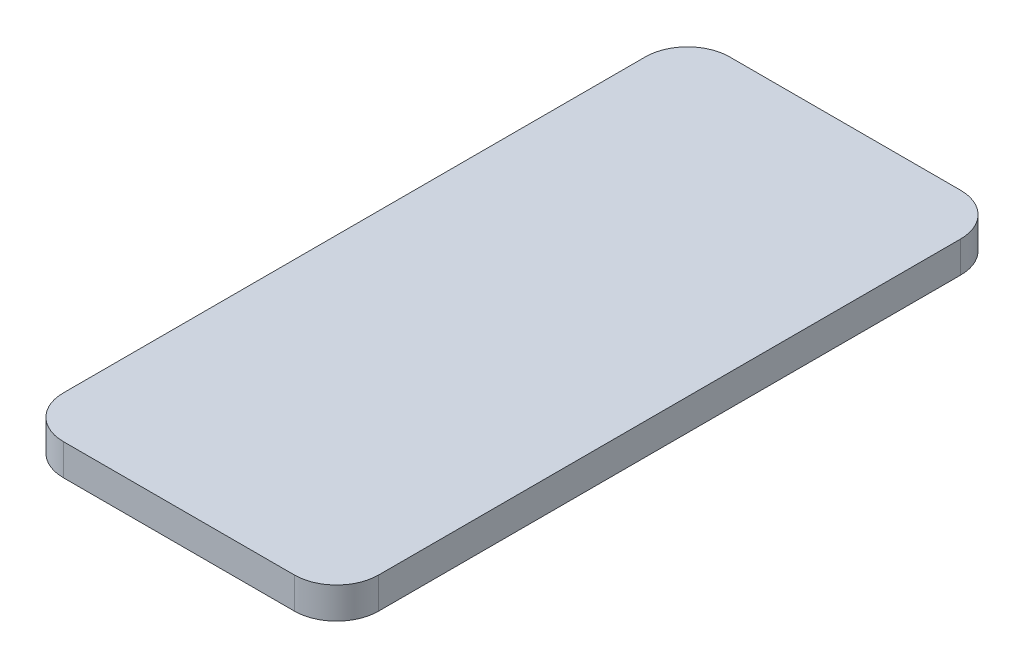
ISO-10303-21;
HEADER;
FILE_DESCRIPTION(('STEP AP214'),'2;1');
FILE_NAME('part.step','',(''),(''),'','','');
FILE_SCHEMA(('AUTOMOTIVE_DESIGN { 1 0 10303 214 1 1 1 1 }'));
ENDSEC;
DATA;
#1=APPLICATION_CONTEXT('core data for automotive mechanical design processes');
#2=APPLICATION_PROTOCOL_DEFINITION('international standard','automotive_design',2000,#1);
#3=PRODUCT_CONTEXT('',#1,'mechanical');
#4=PRODUCT('Part','Part','',(#3));
#5=PRODUCT_RELATED_PRODUCT_CATEGORY('part','',(#4));
#6=PRODUCT_DEFINITION_FORMATION('','',#4);
#7=PRODUCT_DEFINITION_CONTEXT('part definition',#1,'design');
#8=PRODUCT_DEFINITION('design','',#6,#7);
#9=PRODUCT_DEFINITION_SHAPE('','',#8);
#10=(LENGTH_UNIT() NAMED_UNIT(*) SI_UNIT(.MILLI.,.METRE.));
#11=(NAMED_UNIT(*) PLANE_ANGLE_UNIT() SI_UNIT($,.RADIAN.));
#12=(NAMED_UNIT(*) SI_UNIT($,.STERADIAN.) SOLID_ANGLE_UNIT());
#13=UNCERTAINTY_MEASURE_WITH_UNIT(LENGTH_MEASURE(1.E-05),#10,'distance_accuracy_value','');
#14=(GEOMETRIC_REPRESENTATION_CONTEXT(3) GLOBAL_UNCERTAINTY_ASSIGNED_CONTEXT((#13)) GLOBAL_UNIT_ASSIGNED_CONTEXT((#10,
#11,#12)) REPRESENTATION_CONTEXT('',''));
#15=CARTESIAN_POINT('',(0.,0.,0.));
#16=DIRECTION('',(0.,0.,1.));
#17=DIRECTION('',(1.,0.,0.));
#18=AXIS2_PLACEMENT_3D('',#15,#16,#17);
#19=CARTESIAN_POINT('',(-27.365,-7.42,10.));
#20=DIRECTION('',(0.,1.,0.));
#21=DIRECTION('',(0.,0.,1.));
#22=AXIS2_PLACEMENT_3D('',#19,#20,#21);
#23=CYLINDRICAL_SURFACE('',#22,10.);
#24=CARTESIAN_POINT('',(-27.365,0.,10.));
#25=DIRECTION('',(0.,1.,0.));
#26=DIRECTION('',(0.,0.,-1.));
#27=AXIS2_PLACEMENT_3D('',#24,#25,#26);
#28=CIRCLE('',#27,10.);
#29=CARTESIAN_POINT('',(-27.365,0.,0.));
#30=VERTEX_POINT('',#29);
#31=CARTESIAN_POINT('',(-37.365,0.,10.));
#32=VERTEX_POINT('',#31);
#33=EDGE_CURVE('E136',#30,#32,#28,.T.);
#34=ORIENTED_EDGE('',*,*,#33,.F.);
#35=DIRECTION('',(0.,1.,0.));
#36=VECTOR('',#35,1.);
#37=CARTESIAN_POINT('',(-27.365,-7.42,0.));
#38=LINE('',#37,#36);
#39=CARTESIAN_POINT('',(-27.365,-7.42,0.));
#40=VERTEX_POINT('',#39);
#41=EDGE_CURVE('E11',#40,#30,#38,.T.);
#42=ORIENTED_EDGE('',*,*,#41,.F.);
#43=CARTESIAN_POINT('',(-27.365,-7.42,10.));
#44=DIRECTION('',(0.,1.,0.));
#45=DIRECTION('',(0.,0.,-1.));
#46=AXIS2_PLACEMENT_3D('',#43,#44,#45);
#47=CIRCLE('',#46,10.);
#48=CARTESIAN_POINT('',(-37.365,-7.42,10.));
#49=VERTEX_POINT('',#48);
#50=EDGE_CURVE('E156',#40,#49,#47,.T.);
#51=ORIENTED_EDGE('',*,*,#50,.T.);
#52=DIRECTION('',(0.,1.,0.));
#53=VECTOR('',#52,1.);
#54=CARTESIAN_POINT('',(-37.365,-7.42,10.));
#55=LINE('',#54,#53);
#56=EDGE_CURVE('E42',#49,#32,#55,.T.);
#57=ORIENTED_EDGE('',*,*,#56,.T.);
#58=EDGE_LOOP('',(#34,#42,#51,#57));
#59=FACE_BOUND('',#58,.T.);
#60=ADVANCED_FACE('F39',(#59),#23,.T.);
#61=CARTESIAN_POINT('',(-27.365,-7.42,0.));
#62=DIRECTION('',(0.,0.,-1.));
#63=DIRECTION('',(-1.,0.,0.));
#64=AXIS2_PLACEMENT_3D('',#61,#62,#63);
#65=PLANE('',#64);
#66=DIRECTION('',(-1.,0.,0.));
#67=VECTOR('',#66,1.);
#68=CARTESIAN_POINT('',(-27.365,0.,0.));
#69=LINE('',#68,#67);
#70=CARTESIAN_POINT('',(27.365,0.,0.));
#71=VERTEX_POINT('',#70);
#72=EDGE_CURVE('E154',#71,#30,#69,.T.);
#73=ORIENTED_EDGE('',*,*,#72,.F.);
#74=DIRECTION('',(0.,1.,0.));
#75=VECTOR('',#74,1.);
#76=CARTESIAN_POINT('',(27.365,-7.42,0.));
#77=LINE('',#76,#75);
#78=CARTESIAN_POINT('',(27.365,-7.42,0.));
#79=VERTEX_POINT('',#78);
#80=EDGE_CURVE('E48',#79,#71,#77,.T.);
#81=ORIENTED_EDGE('',*,*,#80,.F.);
#82=DIRECTION('',(-1.,0.,0.));
#83=VECTOR('',#82,1.);
#84=CARTESIAN_POINT('',(-27.365,-7.42,0.));
#85=LINE('',#84,#83);
#86=EDGE_CURVE('E126',#79,#40,#85,.T.);
#87=ORIENTED_EDGE('',*,*,#86,.T.);
#88=ORIENTED_EDGE('',*,*,#41,.T.);
#89=EDGE_LOOP('',(#73,#81,#87,#88));
#90=FACE_BOUND('',#89,.T.);
#91=ADVANCED_FACE('F168',(#90),#65,.T.);
#92=CARTESIAN_POINT('',(27.365,-7.42,10.));
#93=DIRECTION('',(0.,1.,0.));
#94=DIRECTION('',(0.,0.,1.));
#95=AXIS2_PLACEMENT_3D('',#92,#93,#94);
#96=CYLINDRICAL_SURFACE('',#95,10.);
#97=CARTESIAN_POINT('',(27.365,0.,10.));
#98=DIRECTION('',(0.,1.,0.));
#99=DIRECTION('',(0.,0.,-1.));
#100=AXIS2_PLACEMENT_3D('',#97,#98,#99);
#101=CIRCLE('',#100,10.);
#102=CARTESIAN_POINT('',(37.365,0.,10.));
#103=VERTEX_POINT('',#102);
#104=EDGE_CURVE('E113',#103,#71,#101,.T.);
#105=ORIENTED_EDGE('',*,*,#104,.F.);
#106=DIRECTION('',(0.,1.,0.));
#107=VECTOR('',#106,1.);
#108=CARTESIAN_POINT('',(37.365,-7.42,10.));
#109=LINE('',#108,#107);
#110=CARTESIAN_POINT('',(37.365,-7.42,10.));
#111=VERTEX_POINT('',#110);
#112=EDGE_CURVE('E108',#111,#103,#109,.T.);
#113=ORIENTED_EDGE('',*,*,#112,.F.);
#114=CARTESIAN_POINT('',(27.365,-7.42,10.));
#115=DIRECTION('',(0.,1.,0.));
#116=DIRECTION('',(0.,0.,-1.));
#117=AXIS2_PLACEMENT_3D('',#114,#115,#116);
#118=CIRCLE('',#117,10.);
#119=EDGE_CURVE('E111',#111,#79,#118,.T.);
#120=ORIENTED_EDGE('',*,*,#119,.T.);
#121=ORIENTED_EDGE('',*,*,#80,.T.);
#122=EDGE_LOOP('',(#105,#113,#120,#121));
#123=FACE_BOUND('',#122,.T.);
#124=ADVANCED_FACE('F110',(#123),#96,.T.);
#125=CARTESIAN_POINT('',(37.365,-7.42,10.));
#126=DIRECTION('',(1.,0.,0.));
#127=DIRECTION('',(0.,0.,-1.));
#128=AXIS2_PLACEMENT_3D('',#125,#126,#127);
#129=PLANE('',#128);
#130=DIRECTION('',(0.,0.,-1.));
#131=VECTOR('',#130,1.);
#132=CARTESIAN_POINT('',(37.365,0.,10.));
#133=LINE('',#132,#131);
#134=CARTESIAN_POINT('',(37.365,0.,147.9));
#135=VERTEX_POINT('',#134);
#136=EDGE_CURVE('E151',#135,#103,#133,.T.);
#137=ORIENTED_EDGE('',*,*,#136,.F.);
#138=DIRECTION('',(0.,1.,0.));
#139=VECTOR('',#138,1.);
#140=CARTESIAN_POINT('',(37.365,-7.42,147.9));
#141=LINE('',#140,#139);
#142=CARTESIAN_POINT('',(37.365,-7.42,147.9));
#143=VERTEX_POINT('',#142);
#144=EDGE_CURVE('E118',#143,#135,#141,.T.);
#145=ORIENTED_EDGE('',*,*,#144,.F.);
#146=DIRECTION('',(0.,0.,-1.));
#147=VECTOR('',#146,1.);
#148=CARTESIAN_POINT('',(37.365,-7.42,10.));
#149=LINE('',#148,#147);
#150=EDGE_CURVE('E124',#143,#111,#149,.T.);
#151=ORIENTED_EDGE('',*,*,#150,.T.);
#152=ORIENTED_EDGE('',*,*,#112,.T.);
#153=EDGE_LOOP('',(#137,#145,#151,#152));
#154=FACE_BOUND('',#153,.T.);
#155=ADVANCED_FACE('F128',(#154),#129,.T.);
#156=CARTESIAN_POINT('',(27.365,-7.42,147.9));
#157=DIRECTION('',(0.,1.,0.));
#158=DIRECTION('',(0.,0.,1.));
#159=AXIS2_PLACEMENT_3D('',#156,#157,#158);
#160=CYLINDRICAL_SURFACE('',#159,10.);
#161=CARTESIAN_POINT('',(27.365,0.,147.9));
#162=DIRECTION('',(0.,1.,0.));
#163=DIRECTION('',(0.,0.,-1.));
#164=AXIS2_PLACEMENT_3D('',#161,#162,#163);
#165=CIRCLE('',#164,10.);
#166=CARTESIAN_POINT('',(27.365,0.,157.9));
#167=VERTEX_POINT('',#166);
#168=EDGE_CURVE('E148',#167,#135,#165,.T.);
#169=ORIENTED_EDGE('',*,*,#168,.F.);
#170=DIRECTION('',(0.,1.,0.));
#171=VECTOR('',#170,1.);
#172=CARTESIAN_POINT('',(27.365,-7.42,157.9));
#173=LINE('',#172,#171);
#174=CARTESIAN_POINT('',(27.365,-7.42,157.9));
#175=VERTEX_POINT('',#174);
#176=EDGE_CURVE('E160',#175,#167,#173,.T.);
#177=ORIENTED_EDGE('',*,*,#176,.F.);
#178=CARTESIAN_POINT('',(27.365,-7.42,147.9));
#179=DIRECTION('',(0.,1.,0.));
#180=DIRECTION('',(0.,0.,-1.));
#181=AXIS2_PLACEMENT_3D('',#178,#179,#180);
#182=CIRCLE('',#181,10.);
#183=EDGE_CURVE('E129',#175,#143,#182,.T.);
#184=ORIENTED_EDGE('',*,*,#183,.T.);
#185=ORIENTED_EDGE('',*,*,#144,.T.);
#186=EDGE_LOOP('',(#169,#177,#184,#185));
#187=FACE_BOUND('',#186,.T.);
#188=ADVANCED_FACE('F181',(#187),#160,.T.);
#189=CARTESIAN_POINT('',(27.365,-7.42,157.9));
#190=DIRECTION('',(0.,0.,1.));
#191=DIRECTION('',(1.,0.,0.));
#192=AXIS2_PLACEMENT_3D('',#189,#190,#191);
#193=PLANE('',#192);
#194=DIRECTION('',(1.,0.,0.));
#195=VECTOR('',#194,1.);
#196=CARTESIAN_POINT('',(27.365,0.,157.9));
#197=LINE('',#196,#195);
#198=CARTESIAN_POINT('',(-27.365,0.,157.9));
#199=VERTEX_POINT('',#198);
#200=EDGE_CURVE('E145',#199,#167,#197,.T.);
#201=ORIENTED_EDGE('',*,*,#200,.F.);
#202=DIRECTION('',(0.,1.,0.));
#203=VECTOR('',#202,1.);
#204=CARTESIAN_POINT('',(-27.365,-7.42,157.9));
#205=LINE('',#204,#203);
#206=CARTESIAN_POINT('',(-27.365,-7.42,157.9));
#207=VERTEX_POINT('',#206);
#208=EDGE_CURVE('E162',#207,#199,#205,.T.);
#209=ORIENTED_EDGE('',*,*,#208,.F.);
#210=DIRECTION('',(1.,0.,0.));
#211=VECTOR('',#210,1.);
#212=CARTESIAN_POINT('',(27.365,-7.42,157.9));
#213=LINE('',#212,#211);
#214=EDGE_CURVE('E131',#207,#175,#213,.T.);
#215=ORIENTED_EDGE('',*,*,#214,.T.);
#216=ORIENTED_EDGE('',*,*,#176,.T.);
#217=EDGE_LOOP('',(#201,#209,#215,#216));
#218=FACE_BOUND('',#217,.T.);
#219=ADVANCED_FACE('F184',(#218),#193,.T.);
#220=CARTESIAN_POINT('',(-27.365,-7.42,147.9));
#221=DIRECTION('',(0.,1.,0.));
#222=DIRECTION('',(0.,0.,1.));
#223=AXIS2_PLACEMENT_3D('',#220,#221,#222);
#224=CYLINDRICAL_SURFACE('',#223,10.);
#225=CARTESIAN_POINT('',(-27.365,0.,147.9));
#226=DIRECTION('',(0.,1.,0.));
#227=DIRECTION('',(0.,0.,-1.));
#228=AXIS2_PLACEMENT_3D('',#225,#226,#227);
#229=CIRCLE('',#228,10.);
#230=CARTESIAN_POINT('',(-37.365,0.,147.9));
#231=VERTEX_POINT('',#230);
#232=EDGE_CURVE('E142',#231,#199,#229,.T.);
#233=ORIENTED_EDGE('',*,*,#232,.F.);
#234=DIRECTION('',(0.,1.,0.));
#235=VECTOR('',#234,1.);
#236=CARTESIAN_POINT('',(-37.365,-7.42,147.9));
#237=LINE('',#236,#235);
#238=CARTESIAN_POINT('',(-37.365,-7.42,147.9));
#239=VERTEX_POINT('',#238);
#240=EDGE_CURVE('E163',#239,#231,#237,.T.);
#241=ORIENTED_EDGE('',*,*,#240,.F.);
#242=CARTESIAN_POINT('',(-27.365,-7.42,147.9));
#243=DIRECTION('',(0.,1.,0.));
#244=DIRECTION('',(0.,0.,-1.));
#245=AXIS2_PLACEMENT_3D('',#242,#243,#244);
#246=CIRCLE('',#245,10.);
#247=EDGE_CURVE('E279',#239,#207,#246,.T.);
#248=ORIENTED_EDGE('',*,*,#247,.T.);
#249=ORIENTED_EDGE('',*,*,#208,.T.);
#250=EDGE_LOOP('',(#233,#241,#248,#249));
#251=FACE_BOUND('',#250,.T.);
#252=ADVANCED_FACE('F188',(#251),#224,.T.);
#253=CARTESIAN_POINT('',(-37.365,-7.42,147.9));
#254=DIRECTION('',(-1.,0.,0.));
#255=DIRECTION('',(0.,0.,1.));
#256=AXIS2_PLACEMENT_3D('',#253,#254,#255);
#257=PLANE('',#256);
#258=DIRECTION('',(0.,0.,1.));
#259=VECTOR('',#258,1.);
#260=CARTESIAN_POINT('',(-37.365,0.,147.9));
#261=LINE('',#260,#259);
#262=EDGE_CURVE('E139',#32,#231,#261,.T.);
#263=ORIENTED_EDGE('',*,*,#262,.F.);
#264=ORIENTED_EDGE('',*,*,#56,.F.);
#265=DIRECTION('',(0.,0.,1.));
#266=VECTOR('',#265,1.);
#267=CARTESIAN_POINT('',(-37.365,-7.42,147.9));
#268=LINE('',#267,#266);
#269=EDGE_CURVE('E280',#49,#239,#268,.T.);
#270=ORIENTED_EDGE('',*,*,#269,.T.);
#271=ORIENTED_EDGE('',*,*,#240,.T.);
#272=EDGE_LOOP('',(#263,#264,#270,#271));
#273=FACE_BOUND('',#272,.T.);
#274=ADVANCED_FACE('F165',(#273),#257,.T.);
#275=CARTESIAN_POINT('',(-27.365,-7.42,10.));
#276=DIRECTION('',(0.,-1.,0.));
#277=DIRECTION('',(0.,0.,-1.));
#278=AXIS2_PLACEMENT_3D('',#275,#276,#277);
#279=PLANE('',#278);
#280=ORIENTED_EDGE('',*,*,#50,.F.);
#281=ORIENTED_EDGE('',*,*,#86,.F.);
#282=ORIENTED_EDGE('',*,*,#119,.F.);
#283=ORIENTED_EDGE('',*,*,#150,.F.);
#284=ORIENTED_EDGE('',*,*,#183,.F.);
#285=ORIENTED_EDGE('',*,*,#214,.F.);
#286=ORIENTED_EDGE('',*,*,#247,.F.);
#287=ORIENTED_EDGE('',*,*,#269,.F.);
#288=EDGE_LOOP('',(#280,#281,#282,#283,#284,#285,#286,#287));
#289=FACE_BOUND('',#288,.T.);
#290=ADVANCED_FACE('F122',(#289),#279,.T.);
#291=CARTESIAN_POINT('',(-27.365,0.,10.));
#292=DIRECTION('',(0.,-1.,0.));
#293=DIRECTION('',(0.,0.,-1.));
#294=AXIS2_PLACEMENT_3D('',#291,#292,#293);
#295=PLANE('',#294);
#296=ORIENTED_EDGE('',*,*,#33,.T.);
#297=ORIENTED_EDGE('',*,*,#262,.T.);
#298=ORIENTED_EDGE('',*,*,#232,.T.);
#299=ORIENTED_EDGE('',*,*,#200,.T.);
#300=ORIENTED_EDGE('',*,*,#168,.T.);
#301=ORIENTED_EDGE('',*,*,#136,.T.);
#302=ORIENTED_EDGE('',*,*,#104,.T.);
#303=ORIENTED_EDGE('',*,*,#72,.T.);
#304=EDGE_LOOP('',(#296,#297,#298,#299,#300,#301,#302,#303));
#305=FACE_BOUND('',#304,.T.);
#306=ADVANCED_FACE('F167',(#305),#295,.F.);
#307=CLOSED_SHELL('',(#60,#91,#124,#155,#188,#219,#252,#274,#290,#306));
#308=MANIFOLD_SOLID_BREP('B2',#307);
#309=ADVANCED_BREP_SHAPE_REPRESENTATION('',(#18,#308),#14);
#310=SHAPE_DEFINITION_REPRESENTATION(#9,#309);
ENDSEC;
END-ISO-10303-21;
